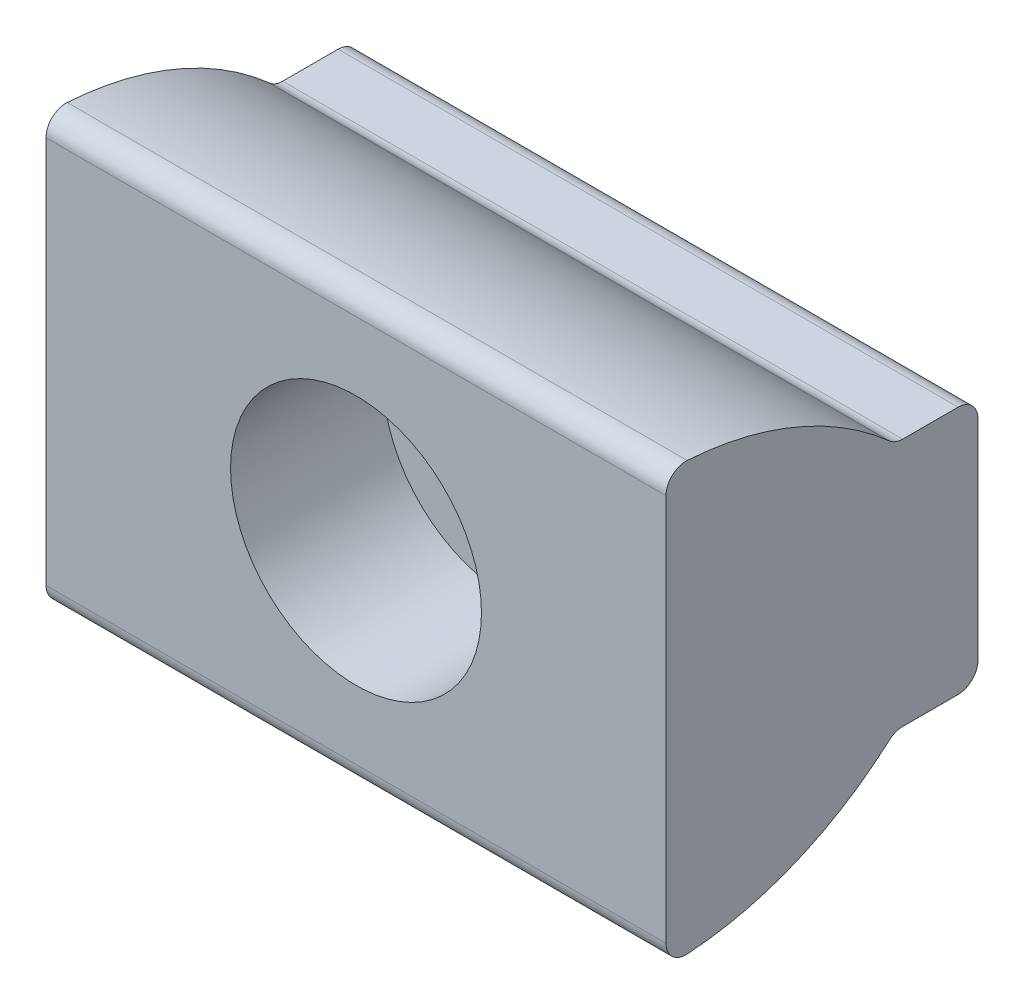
ISO-10303-21;
HEADER;
FILE_DESCRIPTION(('STEP AP214'),'2;1');
FILE_NAME('part.step','',(''),(''),'','','');
FILE_SCHEMA(('AUTOMOTIVE_DESIGN { 1 0 10303 214 1 1 1 1 }'));
ENDSEC;
DATA;
#1=APPLICATION_CONTEXT('core data for automotive mechanical design processes');
#2=APPLICATION_PROTOCOL_DEFINITION('international standard','automotive_design',2000,#1);
#3=PRODUCT_CONTEXT('',#1,'mechanical');
#4=PRODUCT('Part','Part','',(#3));
#5=PRODUCT_RELATED_PRODUCT_CATEGORY('part','',(#4));
#6=PRODUCT_DEFINITION_FORMATION('','',#4);
#7=PRODUCT_DEFINITION_CONTEXT('part definition',#1,'design');
#8=PRODUCT_DEFINITION('design','',#6,#7);
#9=PRODUCT_DEFINITION_SHAPE('','',#8);
#10=(LENGTH_UNIT() NAMED_UNIT(*) SI_UNIT(.MILLI.,.METRE.));
#11=(NAMED_UNIT(*) PLANE_ANGLE_UNIT() SI_UNIT($,.RADIAN.));
#12=(NAMED_UNIT(*) SI_UNIT($,.STERADIAN.) SOLID_ANGLE_UNIT());
#13=UNCERTAINTY_MEASURE_WITH_UNIT(LENGTH_MEASURE(1.E-05),#10,'distance_accuracy_value','');
#14=(GEOMETRIC_REPRESENTATION_CONTEXT(3) GLOBAL_UNCERTAINTY_ASSIGNED_CONTEXT((#13)) GLOBAL_UNIT_ASSIGNED_CONTEXT((#10,
#11,#12)) REPRESENTATION_CONTEXT('',''));
#15=CARTESIAN_POINT('',(0.,0.,0.));
#16=DIRECTION('',(0.,0.,1.));
#17=DIRECTION('',(1.,0.,0.));
#18=AXIS2_PLACEMENT_3D('',#15,#16,#17);
#19=CARTESIAN_POINT('',(5.9309,-2.00025,0.));
#20=DIRECTION('',(0.,0.,1.));
#21=DIRECTION('',(1.,0.,0.));
#22=AXIS2_PLACEMENT_3D('',#19,#20,#21);
#23=PLANE('',#22);
#24=DIRECTION('',(0.,1.,0.));
#25=VECTOR('',#24,1.);
#26=CARTESIAN_POINT('',(-5.9309,-2.00025,0.));
#27=LINE('',#26,#25);
#28=CARTESIAN_POINT('',(-5.9309,-2.00025,0.));
#29=VERTEX_POINT('',#28);
#30=CARTESIAN_POINT('',(-5.9309,2.00025,0.));
#31=VERTEX_POINT('',#30);
#32=EDGE_CURVE('E135',#29,#31,#27,.T.);
#33=ORIENTED_EDGE('',*,*,#32,.T.);
#34=DIRECTION('',(-1.,0.,0.));
#35=VECTOR('',#34,1.);
#36=CARTESIAN_POINT('',(5.9309,2.00025,0.));
#37=LINE('',#36,#35);
#38=CARTESIAN_POINT('',(5.9309,2.00025,0.));
#39=VERTEX_POINT('',#38);
#40=EDGE_CURVE('E186',#39,#31,#37,.T.);
#41=ORIENTED_EDGE('',*,*,#40,.F.);
#42=DIRECTION('',(0.,1.,0.));
#43=VECTOR('',#42,1.);
#44=CARTESIAN_POINT('',(5.9309,-2.00025,0.));
#45=LINE('',#44,#43);
#46=CARTESIAN_POINT('',(5.9309,-2.00025,0.));
#47=VERTEX_POINT('',#46);
#48=EDGE_CURVE('E158',#47,#39,#45,.T.);
#49=ORIENTED_EDGE('',*,*,#48,.F.);
#50=DIRECTION('',(-1.,0.,0.));
#51=VECTOR('',#50,1.);
#52=CARTESIAN_POINT('',(5.9309,-2.00025,0.));
#53=LINE('',#52,#51);
#54=EDGE_CURVE('E189',#47,#29,#53,.T.);
#55=ORIENTED_EDGE('',*,*,#54,.T.);
#56=EDGE_LOOP('',(#33,#41,#49,#55));
#57=FACE_BOUND('',#56,.T.);
#58=CARTESIAN_POINT('',(0.,0.,0.));
#59=DIRECTION('',(0.,0.,1.));
#60=DIRECTION('',(1.,0.,0.));
#61=AXIS2_PLACEMENT_3D('',#58,#59,#60);
#62=CIRCLE('',#61,1.4224);
#63=CARTESIAN_POINT('',(1.4224,0.,0.));
#64=VERTEX_POINT('',#63);
#65=EDGE_CURVE('E18',#64,#64,#62,.F.);
#66=ORIENTED_EDGE('',*,*,#65,.F.);
#67=EDGE_LOOP('',(#66));
#68=FACE_BOUND('',#67,.T.);
#69=ADVANCED_FACE('F14',(#57,#68),#23,.F.);
#70=CARTESIAN_POINT('',(5.9309,-3.70910590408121,5.969));
#71=DIRECTION('',(0.,0.,-1.));
#72=DIRECTION('',(-1.,0.,0.));
#73=AXIS2_PLACEMENT_3D('',#70,#71,#72);
#74=PLANE('',#73);
#75=DIRECTION('',(0.,-1.,0.));
#76=VECTOR('',#75,1.);
#77=CARTESIAN_POINT('',(-5.9309,-3.70910590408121,5.969));
#78=LINE('',#77,#76);
#79=CARTESIAN_POINT('',(-5.9309,3.70910590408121,5.969));
#80=VERTEX_POINT('',#79);
#81=CARTESIAN_POINT('',(-5.9309,-3.70910590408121,5.969));
#82=VERTEX_POINT('',#81);
#83=EDGE_CURVE('E147',#80,#82,#78,.T.);
#84=ORIENTED_EDGE('',*,*,#83,.T.);
#85=DIRECTION('',(-1.,0.,0.));
#86=VECTOR('',#85,1.);
#87=CARTESIAN_POINT('',(5.9309,-3.70910590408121,5.969));
#88=LINE('',#87,#86);
#89=CARTESIAN_POINT('',(5.9309,-3.70910590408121,5.969));
#90=VERTEX_POINT('',#89);
#91=EDGE_CURVE('E122',#90,#82,#88,.T.);
#92=ORIENTED_EDGE('',*,*,#91,.F.);
#93=DIRECTION('',(0.,-1.,0.));
#94=VECTOR('',#93,1.);
#95=CARTESIAN_POINT('',(5.9309,-3.70910590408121,5.969));
#96=LINE('',#95,#94);
#97=CARTESIAN_POINT('',(5.9309,3.70910590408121,5.969));
#98=VERTEX_POINT('',#97);
#99=EDGE_CURVE('E31',#98,#90,#96,.T.);
#100=ORIENTED_EDGE('',*,*,#99,.F.);
#101=DIRECTION('',(-1.,0.,0.));
#102=VECTOR('',#101,1.);
#103=CARTESIAN_POINT('',(5.9309,3.70910590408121,5.969));
#104=LINE('',#103,#102);
#105=EDGE_CURVE('E171',#98,#80,#104,.T.);
#106=ORIENTED_EDGE('',*,*,#105,.T.);
#107=EDGE_LOOP('',(#84,#92,#100,#106));
#108=FACE_BOUND('',#107,.T.);
#109=CARTESIAN_POINT('',(0.,0.,5.969));
#110=DIRECTION('',(0.,0.,-1.));
#111=DIRECTION('',(-1.,0.,0.));
#112=AXIS2_PLACEMENT_3D('',#109,#110,#111);
#113=CIRCLE('',#112,2.4003);
#114=CARTESIAN_POINT('',(-2.4003,0.,5.969));
#115=VERTEX_POINT('',#114);
#116=EDGE_CURVE('E125',#115,#115,#113,.F.);
#117=ORIENTED_EDGE('',*,*,#116,.F.);
#118=EDGE_LOOP('',(#117));
#119=FACE_BOUND('',#118,.T.);
#120=ADVANCED_FACE('F224',(#108,#119),#74,.F.);
#121=CARTESIAN_POINT('',(5.9309,-3.70910590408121,5.588));
#122=DIRECTION('',(-1.,0.,0.));
#123=DIRECTION('',(0.,-1.,0.));
#124=AXIS2_PLACEMENT_3D('',#121,#122,#123);
#125=CYLINDRICAL_SURFACE('',#124,0.381);
#126=CARTESIAN_POINT('',(-5.9309,-3.70910590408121,5.588));
#127=DIRECTION('',(1.,0.,0.));
#128=DIRECTION('',(0.,-1.,0.));
#129=AXIS2_PLACEMENT_3D('',#126,#127,#128);
#130=CIRCLE('',#129,0.381);
#131=CARTESIAN_POINT('',(-5.9309,-4.08935148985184,5.56403555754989));
#132=VERTEX_POINT('',#131);
#133=EDGE_CURVE('E109',#82,#132,#130,.T.);
#134=ORIENTED_EDGE('',*,*,#133,.T.);
#135=DIRECTION('',(-1.,0.,0.));
#136=VECTOR('',#135,1.);
#137=CARTESIAN_POINT('',(5.9309,-4.08935148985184,5.56403555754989));
#138=LINE('',#137,#136);
#139=CARTESIAN_POINT('',(5.9309,-4.08935148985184,5.56403555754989));
#140=VERTEX_POINT('',#139);
#141=EDGE_CURVE('E9',#140,#132,#138,.T.);
#142=ORIENTED_EDGE('',*,*,#141,.F.);
#143=CARTESIAN_POINT('',(5.9309,-3.70910590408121,5.588));
#144=DIRECTION('',(1.,0.,0.));
#145=DIRECTION('',(0.,-1.,0.));
#146=AXIS2_PLACEMENT_3D('',#143,#144,#145);
#147=CIRCLE('',#146,0.381);
#148=EDGE_CURVE('E149',#90,#140,#147,.T.);
#149=ORIENTED_EDGE('',*,*,#148,.F.);
#150=ORIENTED_EDGE('',*,*,#91,.T.);
#151=EDGE_LOOP('',(#134,#142,#149,#150));
#152=FACE_BOUND('',#151,.T.);
#153=ADVANCED_FACE('F16',(#152),#125,.T.);
#154=CARTESIAN_POINT('',(5.9309,2.33624935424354,5.969));
#155=DIRECTION('',(-1.,0.,0.));
#156=DIRECTION('',(0.,-1.,0.));
#157=AXIS2_PLACEMENT_3D('',#154,#155,#156);
#158=CYLINDRICAL_SURFACE('',#157,6.43834935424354);
#159=CARTESIAN_POINT('',(-5.9309,2.33624935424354,5.969));
#160=DIRECTION('',(1.,0.,0.));
#161=DIRECTION('',(0.,1.,0.));
#162=AXIS2_PLACEMENT_3D('',#159,#160,#161);
#163=CIRCLE('',#162,6.43834935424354);
#164=CARTESIAN_POINT('',(-5.9309,-2.47739463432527,1.69335104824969));
#165=VERTEX_POINT('',#164);
#166=EDGE_CURVE('E105',#132,#165,#163,.T.);
#167=ORIENTED_EDGE('',*,*,#166,.T.);
#168=DIRECTION('',(-1.,0.,0.));
#169=VECTOR('',#168,1.);
#170=CARTESIAN_POINT('',(5.9309,-2.47739463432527,1.69335104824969));
#171=LINE('',#170,#169);
#172=CARTESIAN_POINT('',(5.9309,-2.47739463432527,1.69335104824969));
#173=VERTEX_POINT('',#172);
#174=EDGE_CURVE('E23',#173,#165,#171,.T.);
#175=ORIENTED_EDGE('',*,*,#174,.F.);
#176=CARTESIAN_POINT('',(5.9309,2.33624935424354,5.969));
#177=DIRECTION('',(1.,0.,0.));
#178=DIRECTION('',(0.,1.,0.));
#179=AXIS2_PLACEMENT_3D('',#176,#177,#178);
#180=CIRCLE('',#179,6.43834935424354);
#181=EDGE_CURVE('E118',#140,#173,#180,.T.);
#182=ORIENTED_EDGE('',*,*,#181,.F.);
#183=ORIENTED_EDGE('',*,*,#141,.T.);
#184=EDGE_LOOP('',(#167,#175,#182,#183));
#185=FACE_BOUND('',#184,.T.);
#186=ADVANCED_FACE('F117',(#185),#158,.T.);
#187=CARTESIAN_POINT('',(5.9309,-2.76225,1.44033243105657));
#188=DIRECTION('',(-1.,0.,0.));
#189=DIRECTION('',(0.,-1.,0.));
#190=AXIS2_PLACEMENT_3D('',#187,#188,#189);
#191=CYLINDRICAL_SURFACE('',#190,0.381);
#192=CARTESIAN_POINT('',(-5.9309,-2.76225,1.44033243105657));
#193=DIRECTION('',(-1.,0.,0.));
#194=DIRECTION('',(0.,-1.,0.));
#195=AXIS2_PLACEMENT_3D('',#192,#193,#194);
#196=CIRCLE('',#195,0.381);
#197=CARTESIAN_POINT('',(-5.9309,-2.38125,1.44033243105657));
#198=VERTEX_POINT('',#197);
#199=EDGE_CURVE('E111',#165,#198,#196,.T.);
#200=ORIENTED_EDGE('',*,*,#199,.T.);
#201=DIRECTION('',(-1.,0.,0.));
#202=VECTOR('',#201,1.);
#203=CARTESIAN_POINT('',(5.9309,-2.38125,1.44033243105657));
#204=LINE('',#203,#202);
#205=CARTESIAN_POINT('',(5.9309,-2.38125,1.44033243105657));
#206=VERTEX_POINT('',#205);
#207=EDGE_CURVE('E195',#206,#198,#204,.T.);
#208=ORIENTED_EDGE('',*,*,#207,.F.);
#209=CARTESIAN_POINT('',(5.9309,-2.76225,1.44033243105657));
#210=DIRECTION('',(-1.,0.,0.));
#211=DIRECTION('',(0.,-1.,0.));
#212=AXIS2_PLACEMENT_3D('',#209,#210,#211);
#213=CIRCLE('',#212,0.381);
#214=EDGE_CURVE('E152',#173,#206,#213,.T.);
#215=ORIENTED_EDGE('',*,*,#214,.F.);
#216=ORIENTED_EDGE('',*,*,#174,.T.);
#217=EDGE_LOOP('',(#200,#208,#215,#216));
#218=FACE_BOUND('',#217,.T.);
#219=ADVANCED_FACE('F245',(#218),#191,.F.);
#220=CARTESIAN_POINT('',(5.9309,-2.38125,0.381));
#221=DIRECTION('',(0.,1.,0.));
#222=DIRECTION('',(0.,0.,1.));
#223=AXIS2_PLACEMENT_3D('',#220,#221,#222);
#224=PLANE('',#223);
#225=DIRECTION('',(0.,0.,-1.));
#226=VECTOR('',#225,1.);
#227=CARTESIAN_POINT('',(-5.9309,-2.38125,0.381));
#228=LINE('',#227,#226);
#229=CARTESIAN_POINT('',(-5.9309,-2.38125,0.381));
#230=VERTEX_POINT('',#229);
#231=EDGE_CURVE('E131',#198,#230,#228,.T.);
#232=ORIENTED_EDGE('',*,*,#231,.T.);
#233=DIRECTION('',(-1.,0.,0.));
#234=VECTOR('',#233,1.);
#235=CARTESIAN_POINT('',(5.9309,-2.38125,0.381));
#236=LINE('',#235,#234);
#237=CARTESIAN_POINT('',(5.9309,-2.38125,0.381));
#238=VERTEX_POINT('',#237);
#239=EDGE_CURVE('E192',#238,#230,#236,.T.);
#240=ORIENTED_EDGE('',*,*,#239,.F.);
#241=DIRECTION('',(0.,0.,-1.));
#242=VECTOR('',#241,1.);
#243=CARTESIAN_POINT('',(5.9309,-2.38125,0.381));
#244=LINE('',#243,#242);
#245=EDGE_CURVE('E154',#206,#238,#244,.T.);
#246=ORIENTED_EDGE('',*,*,#245,.F.);
#247=ORIENTED_EDGE('',*,*,#207,.T.);
#248=EDGE_LOOP('',(#232,#240,#246,#247));
#249=FACE_BOUND('',#248,.T.);
#250=ADVANCED_FACE('F241',(#249),#224,.F.);
#251=CARTESIAN_POINT('',(5.9309,-2.00025,0.381));
#252=DIRECTION('',(-1.,0.,0.));
#253=DIRECTION('',(0.,-1.,0.));
#254=AXIS2_PLACEMENT_3D('',#251,#252,#253);
#255=CYLINDRICAL_SURFACE('',#254,0.381);
#256=CARTESIAN_POINT('',(-5.9309,-2.00025,0.381));
#257=DIRECTION('',(1.,0.,0.));
#258=DIRECTION('',(0.,1.,0.));
#259=AXIS2_PLACEMENT_3D('',#256,#257,#258);
#260=CIRCLE('',#259,0.381);
#261=EDGE_CURVE('E133',#230,#29,#260,.T.);
#262=ORIENTED_EDGE('',*,*,#261,.T.);
#263=ORIENTED_EDGE('',*,*,#54,.F.);
#264=CARTESIAN_POINT('',(5.9309,-2.00025,0.381));
#265=DIRECTION('',(1.,0.,0.));
#266=DIRECTION('',(0.,1.,0.));
#267=AXIS2_PLACEMENT_3D('',#264,#265,#266);
#268=CIRCLE('',#267,0.381);
#269=EDGE_CURVE('E156',#238,#47,#268,.T.);
#270=ORIENTED_EDGE('',*,*,#269,.F.);
#271=ORIENTED_EDGE('',*,*,#239,.T.);
#272=EDGE_LOOP('',(#262,#263,#270,#271));
#273=FACE_BOUND('',#272,.T.);
#274=ADVANCED_FACE('F238',(#273),#255,.T.);
#275=CARTESIAN_POINT('',(5.9309,2.00025,0.381));
#276=DIRECTION('',(-1.,0.,0.));
#277=DIRECTION('',(0.,-1.,0.));
#278=AXIS2_PLACEMENT_3D('',#275,#276,#277);
#279=CYLINDRICAL_SURFACE('',#278,0.381);
#280=CARTESIAN_POINT('',(-5.9309,2.00025,0.381));
#281=DIRECTION('',(1.,0.,0.));
#282=DIRECTION('',(0.,1.,0.));
#283=AXIS2_PLACEMENT_3D('',#280,#281,#282);
#284=CIRCLE('',#283,0.381);
#285=CARTESIAN_POINT('',(-5.9309,2.38125,0.381));
#286=VERTEX_POINT('',#285);
#287=EDGE_CURVE('E137',#31,#286,#284,.T.);
#288=ORIENTED_EDGE('',*,*,#287,.T.);
#289=DIRECTION('',(-1.,0.,0.));
#290=VECTOR('',#289,1.);
#291=CARTESIAN_POINT('',(5.9309,2.38125,0.381));
#292=LINE('',#291,#290);
#293=CARTESIAN_POINT('',(5.9309,2.38125,0.381));
#294=VERTEX_POINT('',#293);
#295=EDGE_CURVE('E183',#294,#286,#292,.T.);
#296=ORIENTED_EDGE('',*,*,#295,.F.);
#297=CARTESIAN_POINT('',(5.9309,2.00025,0.381));
#298=DIRECTION('',(1.,0.,0.));
#299=DIRECTION('',(0.,1.,0.));
#300=AXIS2_PLACEMENT_3D('',#297,#298,#299);
#301=CIRCLE('',#300,0.381);
#302=EDGE_CURVE('E160',#39,#294,#301,.T.);
#303=ORIENTED_EDGE('',*,*,#302,.F.);
#304=ORIENTED_EDGE('',*,*,#40,.T.);
#305=EDGE_LOOP('',(#288,#296,#303,#304));
#306=FACE_BOUND('',#305,.T.);
#307=ADVANCED_FACE('F236',(#306),#279,.T.);
#308=CARTESIAN_POINT('',(5.9309,2.38125,0.381));
#309=DIRECTION('',(0.,-1.,0.));
#310=DIRECTION('',(0.,0.,-1.));
#311=AXIS2_PLACEMENT_3D('',#308,#309,#310);
#312=PLANE('',#311);
#313=DIRECTION('',(0.,0.,1.));
#314=VECTOR('',#313,1.);
#315=CARTESIAN_POINT('',(-5.9309,2.38125,0.381));
#316=LINE('',#315,#314);
#317=CARTESIAN_POINT('',(-5.9309,2.38125,1.44033243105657));
#318=VERTEX_POINT('',#317);
#319=EDGE_CURVE('E139',#286,#318,#316,.T.);
#320=ORIENTED_EDGE('',*,*,#319,.T.);
#321=DIRECTION('',(-1.,0.,0.));
#322=VECTOR('',#321,1.);
#323=CARTESIAN_POINT('',(5.9309,2.38125,1.44033243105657));
#324=LINE('',#323,#322);
#325=CARTESIAN_POINT('',(5.9309,2.38125,1.44033243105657));
#326=VERTEX_POINT('',#325);
#327=EDGE_CURVE('E180',#326,#318,#324,.T.);
#328=ORIENTED_EDGE('',*,*,#327,.F.);
#329=DIRECTION('',(0.,0.,1.));
#330=VECTOR('',#329,1.);
#331=CARTESIAN_POINT('',(5.9309,2.38125,0.381));
#332=LINE('',#331,#330);
#333=EDGE_CURVE('E162',#294,#326,#332,.T.);
#334=ORIENTED_EDGE('',*,*,#333,.F.);
#335=ORIENTED_EDGE('',*,*,#295,.T.);
#336=EDGE_LOOP('',(#320,#328,#334,#335));
#337=FACE_BOUND('',#336,.T.);
#338=ADVANCED_FACE('F303',(#337),#312,.F.);
#339=CARTESIAN_POINT('',(5.9309,2.76225,1.44033243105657));
#340=DIRECTION('',(-1.,0.,0.));
#341=DIRECTION('',(0.,-1.,0.));
#342=AXIS2_PLACEMENT_3D('',#339,#340,#341);
#343=CYLINDRICAL_SURFACE('',#342,0.381);
#344=CARTESIAN_POINT('',(-5.9309,2.76225,1.44033243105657));
#345=DIRECTION('',(-1.,0.,0.));
#346=DIRECTION('',(0.,-1.,0.));
#347=AXIS2_PLACEMENT_3D('',#344,#345,#346);
#348=CIRCLE('',#347,0.381);
#349=CARTESIAN_POINT('',(-5.9309,2.47739463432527,1.69335104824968));
#350=VERTEX_POINT('',#349);
#351=EDGE_CURVE('E141',#318,#350,#348,.T.);
#352=ORIENTED_EDGE('',*,*,#351,.T.);
#353=DIRECTION('',(-1.,0.,0.));
#354=VECTOR('',#353,1.);
#355=CARTESIAN_POINT('',(5.9309,2.47739463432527,1.69335104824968));
#356=LINE('',#355,#354);
#357=CARTESIAN_POINT('',(5.9309,2.47739463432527,1.69335104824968));
#358=VERTEX_POINT('',#357);
#359=EDGE_CURVE('E177',#358,#350,#356,.T.);
#360=ORIENTED_EDGE('',*,*,#359,.F.);
#361=CARTESIAN_POINT('',(5.9309,2.76225,1.44033243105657));
#362=DIRECTION('',(-1.,0.,0.));
#363=DIRECTION('',(0.,-1.,0.));
#364=AXIS2_PLACEMENT_3D('',#361,#362,#363);
#365=CIRCLE('',#364,0.381);
#366=EDGE_CURVE('E164',#326,#358,#365,.T.);
#367=ORIENTED_EDGE('',*,*,#366,.F.);
#368=ORIENTED_EDGE('',*,*,#327,.T.);
#369=EDGE_LOOP('',(#352,#360,#367,#368));
#370=FACE_BOUND('',#369,.T.);
#371=ADVANCED_FACE('F310',(#370),#343,.F.);
#372=CARTESIAN_POINT('',(5.9309,-2.33624935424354,5.969));
#373=DIRECTION('',(-1.,0.,0.));
#374=DIRECTION('',(0.,-1.,0.));
#375=AXIS2_PLACEMENT_3D('',#372,#373,#374);
#376=CYLINDRICAL_SURFACE('',#375,6.43834935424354);
#377=CARTESIAN_POINT('',(-5.9309,-2.33624935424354,5.969));
#378=DIRECTION('',(1.,0.,0.));
#379=DIRECTION('',(0.,-1.,0.));
#380=AXIS2_PLACEMENT_3D('',#377,#378,#379);
#381=CIRCLE('',#380,6.43834935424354);
#382=CARTESIAN_POINT('',(-5.9309,4.08935148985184,5.56403555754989));
#383=VERTEX_POINT('',#382);
#384=EDGE_CURVE('E143',#350,#383,#381,.T.);
#385=ORIENTED_EDGE('',*,*,#384,.T.);
#386=DIRECTION('',(-1.,0.,0.));
#387=VECTOR('',#386,1.);
#388=CARTESIAN_POINT('',(5.9309,4.08935148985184,5.56403555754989));
#389=LINE('',#388,#387);
#390=CARTESIAN_POINT('',(5.9309,4.08935148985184,5.56403555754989));
#391=VERTEX_POINT('',#390);
#392=EDGE_CURVE('E174',#391,#383,#389,.T.);
#393=ORIENTED_EDGE('',*,*,#392,.F.);
#394=CARTESIAN_POINT('',(5.9309,-2.33624935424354,5.969));
#395=DIRECTION('',(1.,0.,0.));
#396=DIRECTION('',(0.,-1.,0.));
#397=AXIS2_PLACEMENT_3D('',#394,#395,#396);
#398=CIRCLE('',#397,6.43834935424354);
#399=EDGE_CURVE('E166',#358,#391,#398,.T.);
#400=ORIENTED_EDGE('',*,*,#399,.F.);
#401=ORIENTED_EDGE('',*,*,#359,.T.);
#402=EDGE_LOOP('',(#385,#393,#400,#401));
#403=FACE_BOUND('',#402,.T.);
#404=ADVANCED_FACE('F318',(#403),#376,.T.);
#405=CARTESIAN_POINT('',(5.9309,3.70910590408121,5.588));
#406=DIRECTION('',(-1.,0.,0.));
#407=DIRECTION('',(0.,-1.,0.));
#408=AXIS2_PLACEMENT_3D('',#405,#406,#407);
#409=CYLINDRICAL_SURFACE('',#408,0.381);
#410=CARTESIAN_POINT('',(-5.9309,3.70910590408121,5.588));
#411=DIRECTION('',(1.,0.,0.));
#412=DIRECTION('',(0.,-1.,0.));
#413=AXIS2_PLACEMENT_3D('',#410,#411,#412);
#414=CIRCLE('',#413,0.381);
#415=EDGE_CURVE('E145',#383,#80,#414,.T.);
#416=ORIENTED_EDGE('',*,*,#415,.T.);
#417=ORIENTED_EDGE('',*,*,#105,.F.);
#418=CARTESIAN_POINT('',(5.9309,3.70910590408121,5.588));
#419=DIRECTION('',(1.,0.,0.));
#420=DIRECTION('',(0.,-1.,0.));
#421=AXIS2_PLACEMENT_3D('',#418,#419,#420);
#422=CIRCLE('',#421,0.381);
#423=EDGE_CURVE('E36',#391,#98,#422,.T.);
#424=ORIENTED_EDGE('',*,*,#423,.F.);
#425=ORIENTED_EDGE('',*,*,#392,.T.);
#426=EDGE_LOOP('',(#416,#417,#424,#425));
#427=FACE_BOUND('',#426,.T.);
#428=ADVANCED_FACE('F327',(#427),#409,.T.);
#429=CARTESIAN_POINT('',(5.9309,-3.70910590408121,5.588));
#430=DIRECTION('',(-1.,0.,0.));
#431=DIRECTION('',(0.,-1.,0.));
#432=AXIS2_PLACEMENT_3D('',#429,#430,#431);
#433=PLANE('',#432);
#434=ORIENTED_EDGE('',*,*,#148,.T.);
#435=ORIENTED_EDGE('',*,*,#181,.T.);
#436=ORIENTED_EDGE('',*,*,#214,.T.);
#437=ORIENTED_EDGE('',*,*,#245,.T.);
#438=ORIENTED_EDGE('',*,*,#269,.T.);
#439=ORIENTED_EDGE('',*,*,#48,.T.);
#440=ORIENTED_EDGE('',*,*,#302,.T.);
#441=ORIENTED_EDGE('',*,*,#333,.T.);
#442=ORIENTED_EDGE('',*,*,#366,.T.);
#443=ORIENTED_EDGE('',*,*,#399,.T.);
#444=ORIENTED_EDGE('',*,*,#423,.T.);
#445=ORIENTED_EDGE('',*,*,#99,.T.);
#446=EDGE_LOOP('',(#434,#435,#436,#437,#438,#439,#440,#441,#442,#443,#444,#445));
#447=FACE_BOUND('',#446,.T.);
#448=ADVANCED_FACE('F336',(#447),#433,.F.);
#449=CARTESIAN_POINT('',(-5.9309,-3.70910590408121,5.588));
#450=DIRECTION('',(-1.,0.,0.));
#451=DIRECTION('',(0.,-1.,0.));
#452=AXIS2_PLACEMENT_3D('',#449,#450,#451);
#453=PLANE('',#452);
#454=ORIENTED_EDGE('',*,*,#133,.F.);
#455=ORIENTED_EDGE('',*,*,#83,.F.);
#456=ORIENTED_EDGE('',*,*,#415,.F.);
#457=ORIENTED_EDGE('',*,*,#384,.F.);
#458=ORIENTED_EDGE('',*,*,#351,.F.);
#459=ORIENTED_EDGE('',*,*,#319,.F.);
#460=ORIENTED_EDGE('',*,*,#287,.F.);
#461=ORIENTED_EDGE('',*,*,#32,.F.);
#462=ORIENTED_EDGE('',*,*,#261,.F.);
#463=ORIENTED_EDGE('',*,*,#231,.F.);
#464=ORIENTED_EDGE('',*,*,#199,.F.);
#465=ORIENTED_EDGE('',*,*,#166,.F.);
#466=EDGE_LOOP('',(#454,#455,#456,#457,#458,#459,#460,#461,#462,#463,#464,#465));
#467=FACE_BOUND('',#466,.T.);
#468=ADVANCED_FACE('F106',(#467),#453,.T.);
#469=CARTESIAN_POINT('',(0.,0.,25.2235199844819));
#470=DIRECTION('',(0.,0.,1.));
#471=DIRECTION('',(1.,0.,0.));
#472=AXIS2_PLACEMENT_3D('',#469,#470,#471);
#473=CYLINDRICAL_SURFACE('',#472,1.4224);
#474=CARTESIAN_POINT('',(0.,0.,3.048));
#475=DIRECTION('',(0.,0.,1.));
#476=DIRECTION('',(1.,0.,0.));
#477=AXIS2_PLACEMENT_3D('',#474,#475,#476);
#478=CIRCLE('',#477,1.4224);
#479=CARTESIAN_POINT('',(1.4224,0.,3.048));
#480=VERTEX_POINT('',#479);
#481=EDGE_CURVE('E202',#480,#480,#478,.T.);
#482=ORIENTED_EDGE('',*,*,#481,.T.);
#483=EDGE_LOOP('',(#482));
#484=FACE_BOUND('',#483,.T.);
#485=ORIENTED_EDGE('',*,*,#65,.T.);
#486=EDGE_LOOP('',(#485));
#487=FACE_BOUND('',#486,.T.);
#488=ADVANCED_FACE('F208',(#484,#487),#473,.F.);
#489=CARTESIAN_POINT('',(0.,0.,25.2235199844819));
#490=DIRECTION('',(0.,0.,1.));
#491=DIRECTION('',(1.,0.,0.));
#492=AXIS2_PLACEMENT_3D('',#489,#490,#491);
#493=CYLINDRICAL_SURFACE('',#492,2.4003);
#494=CARTESIAN_POINT('',(0.,0.,3.048));
#495=DIRECTION('',(0.,0.,1.));
#496=DIRECTION('',(1.,0.,0.));
#497=AXIS2_PLACEMENT_3D('',#494,#495,#496);
#498=CIRCLE('',#497,2.4003);
#499=CARTESIAN_POINT('',(2.4003,0.,3.048));
#500=VERTEX_POINT('',#499);
#501=EDGE_CURVE('E127',#500,#500,#498,.T.);
#502=ORIENTED_EDGE('',*,*,#501,.F.);
#503=EDGE_LOOP('',(#502));
#504=FACE_BOUND('',#503,.T.);
#505=ORIENTED_EDGE('',*,*,#116,.T.);
#506=EDGE_LOOP('',(#505));
#507=FACE_BOUND('',#506,.T.);
#508=ADVANCED_FACE('F213',(#504,#507),#493,.F.);
#509=CARTESIAN_POINT('',(0.,1.4224,3.048));
#510=DIRECTION('',(0.,0.,1.));
#511=DIRECTION('',(1.,0.,0.));
#512=AXIS2_PLACEMENT_3D('',#509,#510,#511);
#513=PLANE('',#512);
#514=ORIENTED_EDGE('',*,*,#501,.T.);
#515=EDGE_LOOP('',(#514));
#516=FACE_BOUND('',#515,.T.);
#517=ORIENTED_EDGE('',*,*,#481,.F.);
#518=EDGE_LOOP('',(#517));
#519=FACE_BOUND('',#518,.T.);
#520=ADVANCED_FACE('F211',(#516,#519),#513,.T.);
#521=CLOSED_SHELL('',(#69,#120,#153,#186,#219,#250,#274,#307,#338,#371,#404,#428,#448,#468,#488,
#508,#520));
#522=MANIFOLD_SOLID_BREP('B1',#521);
#523=ADVANCED_BREP_SHAPE_REPRESENTATION('',(#18,#522),#14);
#524=SHAPE_DEFINITION_REPRESENTATION(#9,#523);
ENDSEC;
END-ISO-10303-21;
